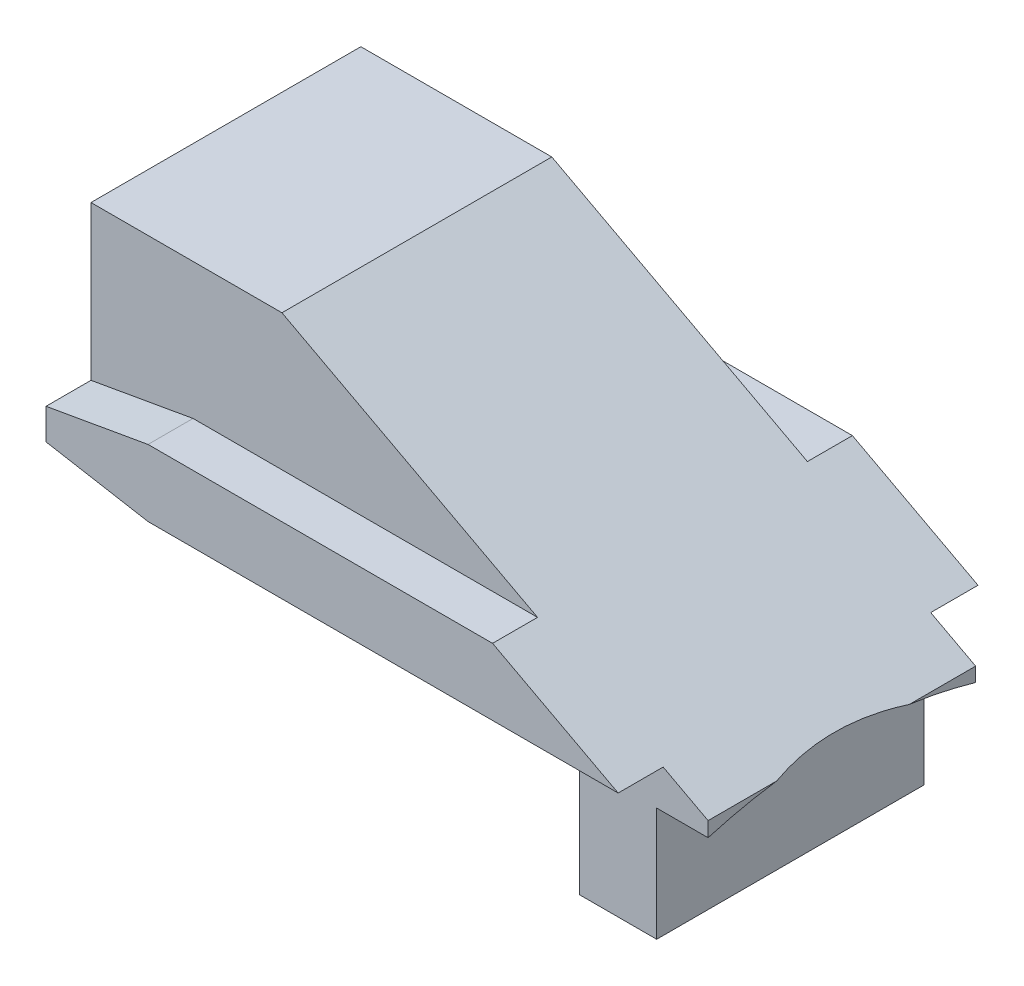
ISO-10303-21;
HEADER;
FILE_DESCRIPTION(('STEP AP214'),'2;1');
FILE_NAME('part.step','',(''),(''),'','','');
FILE_SCHEMA(('AUTOMOTIVE_DESIGN { 1 0 10303 214 1 1 1 1 }'));
ENDSEC;
DATA;
#1=APPLICATION_CONTEXT('core data for automotive mechanical design processes');
#2=APPLICATION_PROTOCOL_DEFINITION('international standard','automotive_design',2000,#1);
#3=PRODUCT_CONTEXT('',#1,'mechanical');
#4=PRODUCT('Part','Part','',(#3));
#5=PRODUCT_RELATED_PRODUCT_CATEGORY('part','',(#4));
#6=PRODUCT_DEFINITION_FORMATION('','',#4);
#7=PRODUCT_DEFINITION_CONTEXT('part definition',#1,'design');
#8=PRODUCT_DEFINITION('design','',#6,#7);
#9=PRODUCT_DEFINITION_SHAPE('','',#8);
#10=(LENGTH_UNIT() NAMED_UNIT(*) SI_UNIT(.MILLI.,.METRE.));
#11=(NAMED_UNIT(*) PLANE_ANGLE_UNIT() SI_UNIT($,.RADIAN.));
#12=(NAMED_UNIT(*) SI_UNIT($,.STERADIAN.) SOLID_ANGLE_UNIT());
#13=UNCERTAINTY_MEASURE_WITH_UNIT(LENGTH_MEASURE(1.E-05),#10,'distance_accuracy_value','');
#14=(GEOMETRIC_REPRESENTATION_CONTEXT(3) GLOBAL_UNCERTAINTY_ASSIGNED_CONTEXT((#13)) GLOBAL_UNIT_ASSIGNED_CONTEXT((#10,
#11,#12)) REPRESENTATION_CONTEXT('',''));
#15=CARTESIAN_POINT('',(0.,0.,0.));
#16=DIRECTION('',(0.,0.,1.));
#17=DIRECTION('',(1.,0.,0.));
#18=AXIS2_PLACEMENT_3D('',#15,#16,#17);
#19=CARTESIAN_POINT('',(20.623730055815,-4.23522905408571,7.26858627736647));
#20=DIRECTION('',(0.,1.,0.));
#21=DIRECTION('',(0.,0.,1.));
#22=AXIS2_PLACEMENT_3D('',#19,#20,#21);
#23=PLANE('',#22);
#24=DIRECTION('',(0.,0.,-1.));
#25=VECTOR('',#24,1.);
#26=CARTESIAN_POINT('',(16.123730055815,-4.23522905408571,7.26858627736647));
#27=LINE('',#26,#25);
#28=CARTESIAN_POINT('',(16.123730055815,-4.23522905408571,4.72608627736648));
#29=VERTEX_POINT('',#28);
#30=CARTESIAN_POINT('',(16.123730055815,-4.23522905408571,-4.64291372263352));
#31=VERTEX_POINT('',#30);
#32=EDGE_CURVE('E315',#29,#31,#27,.T.);
#33=ORIENTED_EDGE('',*,*,#32,.T.);
#34=DIRECTION('',(-1.,0.,0.));
#35=VECTOR('',#34,1.);
#36=CARTESIAN_POINT('',(38.8325356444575,-4.23522905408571,-4.64291372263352));
#37=LINE('',#36,#35);
#38=CARTESIAN_POINT('',(18.823730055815,-4.23522905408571,-4.64291372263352));
#39=VERTEX_POINT('',#38);
#40=EDGE_CURVE('E195',#39,#31,#37,.T.);
#41=ORIENTED_EDGE('',*,*,#40,.F.);
#42=DIRECTION('',(0.,0.,-1.));
#43=VECTOR('',#42,1.);
#44=CARTESIAN_POINT('',(18.823730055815,-4.23522905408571,7.26858627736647));
#45=LINE('',#44,#43);
#46=CARTESIAN_POINT('',(18.823730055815,-4.23522905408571,4.72608627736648));
#47=VERTEX_POINT('',#46);
#48=EDGE_CURVE('E300',#47,#39,#45,.T.);
#49=ORIENTED_EDGE('',*,*,#48,.F.);
#50=DIRECTION('',(-1.,0.,0.));
#51=VECTOR('',#50,1.);
#52=CARTESIAN_POINT('',(38.8325356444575,-4.23522905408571,4.72608627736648));
#53=LINE('',#52,#51);
#54=EDGE_CURVE('E247',#47,#29,#53,.T.);
#55=ORIENTED_EDGE('',*,*,#54,.T.);
#56=EDGE_LOOP('',(#33,#41,#49,#55));
#57=FACE_BOUND('',#56,.T.);
#58=ADVANCED_FACE('F37',(#57),#23,.F.);
#59=CARTESIAN_POINT('',(20.623730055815,0.26477094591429,7.26858627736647));
#60=DIRECTION('',(-1.,0.,0.));
#61=DIRECTION('',(0.,-1.,0.));
#62=AXIS2_PLACEMENT_3D('',#59,#60,#61);
#63=PLANE('',#62);
#64=DIRECTION('',(0.,0.,-1.));
#65=VECTOR('',#64,1.);
#66=CARTESIAN_POINT('',(20.623730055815,0.26477094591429,7.26858627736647));
#67=LINE('',#66,#65);
#68=CARTESIAN_POINT('',(20.623730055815,0.264770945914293,4.72608627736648));
#69=VERTEX_POINT('',#68);
#70=CARTESIAN_POINT('',(20.623730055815,0.26477094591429,2.32308627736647));
#71=VERTEX_POINT('',#70);
#72=EDGE_CURVE('E313',#69,#71,#67,.T.);
#73=ORIENTED_EDGE('',*,*,#72,.F.);
#74=DIRECTION('',(0.,-1.,0.));
#75=VECTOR('',#74,1.);
#76=CARTESIAN_POINT('',(20.623730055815,0.26477094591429,4.72608627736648));
#77=LINE('',#76,#75);
#78=CARTESIAN_POINT('',(20.623730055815,-0.254666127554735,4.72608627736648));
#79=VERTEX_POINT('',#78);
#80=EDGE_CURVE('E275',#69,#79,#77,.T.);
#81=ORIENTED_EDGE('',*,*,#80,.T.);
#82=CARTESIAN_POINT('',(20.623730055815,-16.2952290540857,0.00108627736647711));
#83=DIRECTION('',(1.,0.,0.));
#84=DIRECTION('',(0.,1.,0.));
#85=AXIS2_PLACEMENT_3D('',#82,#83,#84);
#86=CIRCLE('',#85,16.722);
#87=EDGE_CURVE('E301',#71,#79,#86,.T.);
#88=ORIENTED_EDGE('',*,*,#87,.F.);
#89=EDGE_LOOP('',(#73,#81,#88));
#90=FACE_BOUND('',#89,.T.);
#91=ADVANCED_FACE('F387',(#90),#63,.F.);
#92=CARTESIAN_POINT('',(16.123730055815,0.26477094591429,7.26858627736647));
#93=DIRECTION('',(0.,1.,0.));
#94=DIRECTION('',(-1.,0.,0.));
#95=AXIS2_PLACEMENT_3D('',#92,#93,#94);
#96=PLANE('',#95);
#97=DIRECTION('',(0.,0.,-1.));
#98=VECTOR('',#97,1.);
#99=CARTESIAN_POINT('',(-0.985269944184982,0.26477094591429,7.26858627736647));
#100=LINE('',#99,#98);
#101=CARTESIAN_POINT('',(-0.985269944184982,0.26477094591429,4.72608627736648));
#102=VERTEX_POINT('',#101);
#103=CARTESIAN_POINT('',(-0.985269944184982,0.26477094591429,-4.64291372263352));
#104=VERTEX_POINT('',#103);
#105=EDGE_CURVE('E309',#102,#104,#100,.T.);
#106=ORIENTED_EDGE('',*,*,#105,.T.);
#107=DIRECTION('',(1.,0.,0.));
#108=VECTOR('',#107,1.);
#109=CARTESIAN_POINT('',(16.123730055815,0.26477094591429,-4.64291372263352));
#110=LINE('',#109,#108);
#111=CARTESIAN_POINT('',(16.123730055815,0.264770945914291,-4.64291372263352));
#112=VERTEX_POINT('',#111);
#113=EDGE_CURVE('E293',#104,#112,#110,.T.);
#114=ORIENTED_EDGE('',*,*,#113,.T.);
#115=DIRECTION('',(0.,0.,-1.));
#116=VECTOR('',#115,1.);
#117=CARTESIAN_POINT('',(16.123730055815,0.26477094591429,7.26858627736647));
#118=LINE('',#117,#116);
#119=CARTESIAN_POINT('',(16.123730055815,0.264770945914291,4.72608627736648));
#120=VERTEX_POINT('',#119);
#121=EDGE_CURVE('E318',#120,#112,#118,.T.);
#122=ORIENTED_EDGE('',*,*,#121,.F.);
#123=DIRECTION('',(-1.,0.,0.));
#124=VECTOR('',#123,1.);
#125=CARTESIAN_POINT('',(16.123730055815,0.26477094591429,4.72608627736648));
#126=LINE('',#125,#124);
#127=EDGE_CURVE('E281',#120,#102,#126,.T.);
#128=ORIENTED_EDGE('',*,*,#127,.T.);
#129=EDGE_LOOP('',(#106,#114,#122,#128));
#130=FACE_BOUND('',#129,.T.);
#131=ADVANCED_FACE('F393',(#130),#96,.F.);
#132=CARTESIAN_POINT('',(16.123730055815,-4.23522905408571,7.26858627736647));
#133=DIRECTION('',(1.,0.,0.));
#134=DIRECTION('',(0.,0.,-1.));
#135=AXIS2_PLACEMENT_3D('',#132,#133,#134);
#136=PLANE('',#135);
#137=ORIENTED_EDGE('',*,*,#121,.T.);
#138=DIRECTION('',(0.,-1.,0.));
#139=VECTOR('',#138,1.);
#140=CARTESIAN_POINT('',(16.123730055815,-4.23522905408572,-4.64291372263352));
#141=LINE('',#140,#139);
#142=EDGE_CURVE('E290',#112,#31,#141,.T.);
#143=ORIENTED_EDGE('',*,*,#142,.T.);
#144=ORIENTED_EDGE('',*,*,#32,.F.);
#145=DIRECTION('',(0.,1.,0.));
#146=VECTOR('',#145,1.);
#147=CARTESIAN_POINT('',(16.123730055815,-4.23522905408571,4.72608627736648));
#148=LINE('',#147,#146);
#149=EDGE_CURVE('E278',#29,#120,#148,.T.);
#150=ORIENTED_EDGE('',*,*,#149,.T.);
#151=EDGE_LOOP('',(#137,#143,#144,#150));
#152=FACE_BOUND('',#151,.T.);
#153=ADVANCED_FACE('F399',(#152),#136,.F.);
#154=CARTESIAN_POINT('',(20.623730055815,-0.231028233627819,-4.64291372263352));
#155=VERTEX_POINT('',#154);
#156=CARTESIAN_POINT('',(20.623730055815,0.26477094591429,-2.32091372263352));
#157=VERTEX_POINT('',#156);
#158=EDGE_CURVE('E296',#155,#157,#86,.T.);
#159=ORIENTED_EDGE('',*,*,#158,.F.);
#160=DIRECTION('',(0.,1.,0.));
#161=VECTOR('',#160,1.);
#162=CARTESIAN_POINT('',(20.623730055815,0.264770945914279,-4.64291372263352));
#163=LINE('',#162,#161);
#164=CARTESIAN_POINT('',(20.623730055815,0.26477094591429,-4.64291372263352));
#165=VERTEX_POINT('',#164);
#166=EDGE_CURVE('E287',#155,#165,#163,.T.);
#167=ORIENTED_EDGE('',*,*,#166,.T.);
#168=EDGE_CURVE('E312',#157,#165,#67,.T.);
#169=ORIENTED_EDGE('',*,*,#168,.F.);
#170=EDGE_LOOP('',(#159,#167,#169));
#171=FACE_BOUND('',#170,.T.);
#172=ADVANCED_FACE('F396',(#171),#63,.F.);
#173=CARTESIAN_POINT('',(0.814730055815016,10.8037709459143,7.26858627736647));
#174=DIRECTION('',(-0.469692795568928,-0.882829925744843,0.));
#175=DIRECTION('',(0.882829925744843,-0.469692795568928,0.));
#176=AXIS2_PLACEMENT_3D('',#173,#174,#175);
#177=PLANE('',#176);
#178=DIRECTION('',(0.882829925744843,-0.469692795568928,0.));
#179=VECTOR('',#178,1.);
#180=CARTESIAN_POINT('',(30.4453772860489,-4.96064882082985,-4.72391372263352));
#181=LINE('',#180,#179);
#182=CARTESIAN_POINT('',(5.70166430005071,8.20377094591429,-4.72391372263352));
#183=VERTEX_POINT('',#182);
#184=CARTESIAN_POINT('',(14.6522723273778,3.44177094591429,-4.72391372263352));
#185=VERTEX_POINT('',#184);
#186=EDGE_CURVE('E225',#183,#185,#181,.T.);
#187=ORIENTED_EDGE('',*,*,#186,.F.);
#188=DIRECTION('',(0.,0.,-1.));
#189=VECTOR('',#188,1.);
#190=CARTESIAN_POINT('',(5.70166430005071,8.20377094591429,13.3507798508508));
#191=LINE('',#190,#189);
#192=CARTESIAN_POINT('',(5.70166430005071,8.20377094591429,4.72608627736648));
#193=VERTEX_POINT('',#192);
#194=EDGE_CURVE('E206',#193,#183,#191,.T.);
#195=ORIENTED_EDGE('',*,*,#194,.F.);
#196=DIRECTION('',(-0.882829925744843,0.469692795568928,0.));
#197=VECTOR('',#196,1.);
#198=CARTESIAN_POINT('',(33.4980957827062,-6.58478937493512,4.72608627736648));
#199=LINE('',#198,#197);
#200=CARTESIAN_POINT('',(14.6522723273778,3.44177094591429,4.72608627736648));
#201=VERTEX_POINT('',#200);
#202=EDGE_CURVE('E244',#201,#193,#199,.T.);
#203=ORIENTED_EDGE('',*,*,#202,.F.);
#204=DIRECTION('',(0.,0.,-1.));
#205=VECTOR('',#204,1.);
#206=CARTESIAN_POINT('',(14.6522723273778,3.44177094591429,6.3010862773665));
#207=LINE('',#206,#205);
#208=CARTESIAN_POINT('',(14.6522723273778,3.44177094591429,6.30108627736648));
#209=VERTEX_POINT('',#208);
#210=EDGE_CURVE('E246',#209,#201,#207,.T.);
#211=ORIENTED_EDGE('',*,*,#210,.F.);
#212=DIRECTION('',(-0.882829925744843,0.469692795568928,0.));
#213=VECTOR('',#212,1.);
#214=CARTESIAN_POINT('',(34.4683975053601,-7.10101986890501,6.30108627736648));
#215=LINE('',#214,#213);
#216=CARTESIAN_POINT('',(19.0505131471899,1.10177094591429,6.30108627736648));
#217=VERTEX_POINT('',#216);
#218=EDGE_CURVE('E249',#217,#209,#215,.T.);
#219=ORIENTED_EDGE('',*,*,#218,.F.);
#220=DIRECTION('',(0.,0.,1.));
#221=VECTOR('',#220,1.);
#222=CARTESIAN_POINT('',(19.0505131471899,1.10177094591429,4.72608627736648));
#223=LINE('',#222,#221);
#224=CARTESIAN_POINT('',(19.0505131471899,1.10177094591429,4.72608627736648));
#225=VERTEX_POINT('',#224);
#226=EDGE_CURVE('E251',#225,#217,#223,.T.);
#227=ORIENTED_EDGE('',*,*,#226,.F.);
#228=DIRECTION('',(-0.882829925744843,0.469692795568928,0.));
#229=VECTOR('',#228,1.);
#230=CARTESIAN_POINT('',(34.815466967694,-7.28567154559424,4.72608627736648));
#231=LINE('',#230,#229);
#232=EDGE_CURVE('E230',#69,#225,#231,.T.);
#233=ORIENTED_EDGE('',*,*,#232,.F.);
#234=ORIENTED_EDGE('',*,*,#72,.T.);
#235=CARTESIAN_POINT('',(51.7497420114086,-16.2952290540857,0.00108627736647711));
#236=DIRECTION('',(-0.469692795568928,-0.882829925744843,0.));
#237=DIRECTION('',(0.882829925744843,-0.469692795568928,0.));
#238=AXIS2_PLACEMENT_3D('',#235,#236,#237);
#239=ELLIPSE('',#238,35.6019938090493,16.722);
#240=EDGE_CURVE('E306',#71,#157,#239,.T.);
#241=ORIENTED_EDGE('',*,*,#240,.T.);
#242=ORIENTED_EDGE('',*,*,#168,.T.);
#243=DIRECTION('',(0.882829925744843,-0.469692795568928,0.));
#244=VECTOR('',#243,1.);
#245=CARTESIAN_POINT('',(34.4683975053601,-7.10101986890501,-4.64291372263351));
#246=LINE('',#245,#244);
#247=CARTESIAN_POINT('',(19.0505131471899,1.10177094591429,-4.64291372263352));
#248=VERTEX_POINT('',#247);
#249=EDGE_CURVE('E216',#248,#165,#246,.T.);
#250=ORIENTED_EDGE('',*,*,#249,.F.);
#251=DIRECTION('',(0.,0.,1.));
#252=VECTOR('',#251,1.);
#253=CARTESIAN_POINT('',(19.0505131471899,1.10177094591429,-6.29891372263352));
#254=LINE('',#253,#252);
#255=CARTESIAN_POINT('',(19.0505131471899,1.10177094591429,-6.29891372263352));
#256=VERTEX_POINT('',#255);
#257=EDGE_CURVE('E218',#256,#248,#254,.T.);
#258=ORIENTED_EDGE('',*,*,#257,.F.);
#259=DIRECTION('',(0.882829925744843,-0.469692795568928,0.));
#260=VECTOR('',#259,1.);
#261=CARTESIAN_POINT('',(33.4980957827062,-6.58478937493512,-6.29891372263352));
#262=LINE('',#261,#260);
#263=CARTESIAN_POINT('',(14.6522723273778,3.44177094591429,-6.29891372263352));
#264=VERTEX_POINT('',#263);
#265=EDGE_CURVE('E221',#264,#256,#262,.T.);
#266=ORIENTED_EDGE('',*,*,#265,.F.);
#267=DIRECTION('',(0.,0.,-1.));
#268=VECTOR('',#267,1.);
#269=CARTESIAN_POINT('',(14.6522723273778,3.44177094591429,-4.72391372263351));
#270=LINE('',#269,#268);
#271=EDGE_CURVE('E223',#185,#264,#270,.T.);
#272=ORIENTED_EDGE('',*,*,#271,.F.);
#273=EDGE_LOOP('',(#187,#195,#203,#211,#219,#227,#233,#234,#241,#242,#250,#258,#266,#272));
#274=FACE_BOUND('',#273,.T.);
#275=ADVANCED_FACE('F375',(#274),#177,.F.);
#276=CARTESIAN_POINT('',(-0.985269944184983,10.8037709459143,7.26858627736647));
#277=DIRECTION('',(1.,0.,0.));
#278=DIRECTION('',(0.,1.,0.));
#279=AXIS2_PLACEMENT_3D('',#276,#277,#278);
#280=PLANE('',#279);
#281=DIRECTION('',(0.,-1.,0.));
#282=VECTOR('',#281,1.);
#283=CARTESIAN_POINT('',(-0.985269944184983,3.44177094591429,4.72608627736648));
#284=LINE('',#283,#282);
#285=CARTESIAN_POINT('',(-0.985269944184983,8.20377094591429,4.72608627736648));
#286=VERTEX_POINT('',#285);
#287=CARTESIAN_POINT('',(-0.985269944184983,2.81177094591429,4.72608627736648));
#288=VERTEX_POINT('',#287);
#289=EDGE_CURVE('E202',#286,#288,#284,.T.);
#290=ORIENTED_EDGE('',*,*,#289,.F.);
#291=DIRECTION('',(0.,0.,-1.));
#292=VECTOR('',#291,1.);
#293=CARTESIAN_POINT('',(-0.985269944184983,8.20377094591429,13.3507798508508));
#294=LINE('',#293,#292);
#295=CARTESIAN_POINT('',(-0.985269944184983,8.20377094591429,-4.72391372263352));
#296=VERTEX_POINT('',#295);
#297=EDGE_CURVE('E199',#286,#296,#294,.T.);
#298=ORIENTED_EDGE('',*,*,#297,.T.);
#299=DIRECTION('',(0.,1.,0.));
#300=VECTOR('',#299,1.);
#301=CARTESIAN_POINT('',(-0.985269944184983,10.8037709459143,-4.72391372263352));
#302=LINE('',#301,#300);
#303=CARTESIAN_POINT('',(-0.985269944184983,2.81177094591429,-4.72391372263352));
#304=VERTEX_POINT('',#303);
#305=EDGE_CURVE('E186',#304,#296,#302,.T.);
#306=ORIENTED_EDGE('',*,*,#305,.F.);
#307=DIRECTION('',(0.,0.,-1.));
#308=VECTOR('',#307,1.);
#309=CARTESIAN_POINT('',(-0.985269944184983,2.81177094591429,7.26858627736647));
#310=LINE('',#309,#308);
#311=CARTESIAN_POINT('',(-0.985269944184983,2.81177094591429,-6.29891372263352));
#312=VERTEX_POINT('',#311);
#313=EDGE_CURVE('E336',#304,#312,#310,.T.);
#314=ORIENTED_EDGE('',*,*,#313,.T.);
#315=DIRECTION('',(0.,1.,0.));
#316=VECTOR('',#315,1.);
#317=CARTESIAN_POINT('',(-0.985269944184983,3.44177094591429,-6.29891372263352));
#318=LINE('',#317,#316);
#319=CARTESIAN_POINT('',(-0.985269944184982,1.73177094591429,-6.29891372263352));
#320=VERTEX_POINT('',#319);
#321=EDGE_CURVE('E196',#320,#312,#318,.T.);
#322=ORIENTED_EDGE('',*,*,#321,.F.);
#323=DIRECTION('',(0.,0.,1.));
#324=VECTOR('',#323,1.);
#325=CARTESIAN_POINT('',(-0.985269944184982,1.73177094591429,7.26858627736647));
#326=LINE('',#325,#324);
#327=CARTESIAN_POINT('',(-0.985269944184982,1.73177094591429,-4.64291372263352));
#328=VERTEX_POINT('',#327);
#329=EDGE_CURVE('E338',#320,#328,#326,.T.);
#330=ORIENTED_EDGE('',*,*,#329,.T.);
#331=DIRECTION('',(0.,1.,0.));
#332=VECTOR('',#331,1.);
#333=CARTESIAN_POINT('',(-0.985269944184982,1.10177094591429,-4.64291372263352));
#334=LINE('',#333,#332);
#335=EDGE_CURVE('E228',#104,#328,#334,.T.);
#336=ORIENTED_EDGE('',*,*,#335,.F.);
#337=ORIENTED_EDGE('',*,*,#105,.F.);
#338=DIRECTION('',(0.,-1.,0.));
#339=VECTOR('',#338,1.);
#340=CARTESIAN_POINT('',(-0.985269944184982,0.26477094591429,4.72608627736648));
#341=LINE('',#340,#339);
#342=CARTESIAN_POINT('',(-0.985269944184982,1.73177094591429,4.72608627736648));
#343=VERTEX_POINT('',#342);
#344=EDGE_CURVE('E258',#343,#102,#341,.T.);
#345=ORIENTED_EDGE('',*,*,#344,.F.);
#346=DIRECTION('',(0.,0.,1.));
#347=VECTOR('',#346,1.);
#348=CARTESIAN_POINT('',(-0.985269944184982,1.73177094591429,7.26858627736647));
#349=LINE('',#348,#347);
#350=CARTESIAN_POINT('',(-0.985269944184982,1.73177094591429,6.30108627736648));
#351=VERTEX_POINT('',#350);
#352=EDGE_CURVE('E334',#343,#351,#349,.T.);
#353=ORIENTED_EDGE('',*,*,#352,.T.);
#354=DIRECTION('',(0.,-1.,0.));
#355=VECTOR('',#354,1.);
#356=CARTESIAN_POINT('',(-0.985269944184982,1.10177094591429,6.30108627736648));
#357=LINE('',#356,#355);
#358=CARTESIAN_POINT('',(-0.985269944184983,2.81177094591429,6.30108627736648));
#359=VERTEX_POINT('',#358);
#360=EDGE_CURVE('E255',#359,#351,#357,.T.);
#361=ORIENTED_EDGE('',*,*,#360,.F.);
#362=DIRECTION('',(0.,0.,-1.));
#363=VECTOR('',#362,1.);
#364=CARTESIAN_POINT('',(-0.985269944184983,2.81177094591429,7.26858627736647));
#365=LINE('',#364,#363);
#366=EDGE_CURVE('E332',#359,#288,#365,.T.);
#367=ORIENTED_EDGE('',*,*,#366,.T.);
#368=EDGE_LOOP('',(#290,#298,#306,#314,#322,#330,#336,#337,#345,#353,#361,#367));
#369=FACE_BOUND('',#368,.T.);
#370=ADVANCED_FACE('F200',(#369),#280,.F.);
#371=CARTESIAN_POINT('',(18.823730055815,-16.2952290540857,0.00108627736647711));
#372=DIRECTION('',(1.,0.,0.));
#373=DIRECTION('',(0.,1.,0.));
#374=AXIS2_PLACEMENT_3D('',#371,#372,#373);
#375=CYLINDRICAL_SURFACE('',#374,16.722);
#376=CARTESIAN_POINT('',(18.823730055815,-16.2952290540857,0.00108627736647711));
#377=DIRECTION('',(1.,0.,0.));
#378=DIRECTION('',(0.,1.,0.));
#379=AXIS2_PLACEMENT_3D('',#376,#377,#378);
#380=CIRCLE('',#379,16.722);
#381=CARTESIAN_POINT('',(18.823730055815,-0.231028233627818,-4.64291372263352));
#382=VERTEX_POINT('',#381);
#383=CARTESIAN_POINT('',(18.823730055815,-0.254666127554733,4.72608627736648));
#384=VERTEX_POINT('',#383);
#385=EDGE_CURVE('E297',#382,#384,#380,.T.);
#386=ORIENTED_EDGE('',*,*,#385,.F.);
#387=DIRECTION('',(1.,0.,0.));
#388=VECTOR('',#387,1.);
#389=CARTESIAN_POINT('',(18.823730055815,-0.231028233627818,-4.64291372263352));
#390=LINE('',#389,#388);
#391=EDGE_CURVE('E284',#382,#155,#390,.T.);
#392=ORIENTED_EDGE('',*,*,#391,.T.);
#393=ORIENTED_EDGE('',*,*,#158,.T.);
#394=ORIENTED_EDGE('',*,*,#240,.F.);
#395=ORIENTED_EDGE('',*,*,#87,.T.);
#396=DIRECTION('',(1.,0.,0.));
#397=VECTOR('',#396,1.);
#398=CARTESIAN_POINT('',(18.823730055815,-0.254666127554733,4.72608627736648));
#399=LINE('',#398,#397);
#400=EDGE_CURVE('E227',#79,#384,#399,.F.);
#401=ORIENTED_EDGE('',*,*,#400,.T.);
#402=EDGE_LOOP('',(#386,#392,#393,#394,#395,#401));
#403=FACE_BOUND('',#402,.T.);
#404=ADVANCED_FACE('F446',(#403),#375,.F.);
#405=CARTESIAN_POINT('',(18.823730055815,-16.2952290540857,0.00108627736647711));
#406=DIRECTION('',(1.,0.,0.));
#407=DIRECTION('',(0.,1.,0.));
#408=AXIS2_PLACEMENT_3D('',#405,#406,#407);
#409=PLANE('',#408);
#410=DIRECTION('',(0.,-1.,0.));
#411=VECTOR('',#410,1.);
#412=CARTESIAN_POINT('',(18.823730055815,-16.2952290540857,-4.64291372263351));
#413=LINE('',#412,#411);
#414=EDGE_CURVE('E323',#382,#39,#413,.T.);
#415=ORIENTED_EDGE('',*,*,#414,.F.);
#416=ORIENTED_EDGE('',*,*,#385,.T.);
#417=DIRECTION('',(0.,1.,0.));
#418=VECTOR('',#417,1.);
#419=CARTESIAN_POINT('',(18.823730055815,-16.2952290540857,4.72608627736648));
#420=LINE('',#419,#418);
#421=EDGE_CURVE('E321',#47,#384,#420,.T.);
#422=ORIENTED_EDGE('',*,*,#421,.F.);
#423=ORIENTED_EDGE('',*,*,#48,.T.);
#424=EDGE_LOOP('',(#415,#416,#422,#423));
#425=FACE_BOUND('',#424,.T.);
#426=ADVANCED_FACE('F443',(#425),#409,.T.);
#427=CARTESIAN_POINT('',(38.8325356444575,0.264770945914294,4.72608627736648));
#428=DIRECTION('',(0.,0.,-1.));
#429=DIRECTION('',(0.,1.,0.));
#430=AXIS2_PLACEMENT_3D('',#427,#428,#429);
#431=PLANE('',#430);
#432=ORIENTED_EDGE('',*,*,#149,.F.);
#433=ORIENTED_EDGE('',*,*,#54,.F.);
#434=ORIENTED_EDGE('',*,*,#421,.T.);
#435=ORIENTED_EDGE('',*,*,#400,.F.);
#436=ORIENTED_EDGE('',*,*,#80,.F.);
#437=ORIENTED_EDGE('',*,*,#232,.T.);
#438=DIRECTION('',(-1.,0.,0.));
#439=VECTOR('',#438,1.);
#440=CARTESIAN_POINT('',(38.8325356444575,1.1017709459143,4.72608627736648));
#441=LINE('',#440,#439);
#442=CARTESIAN_POINT('',(2.58763760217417,1.10177094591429,4.72608627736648));
#443=VERTEX_POINT('',#442);
#444=EDGE_CURVE('E263',#225,#443,#441,.T.);
#445=ORIENTED_EDGE('',*,*,#444,.T.);
#446=DIRECTION('',(0.984807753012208,-0.17364817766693,0.));
#447=VECTOR('',#446,1.);
#448=CARTESIAN_POINT('',(37.8827536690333,-5.12171030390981,4.72608627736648));
#449=LINE('',#448,#447);
#450=EDGE_CURVE('E45',#443,#343,#449,.F.);
#451=ORIENTED_EDGE('',*,*,#450,.T.);
#452=ORIENTED_EDGE('',*,*,#344,.T.);
#453=ORIENTED_EDGE('',*,*,#127,.F.);
#454=EDGE_LOOP('',(#432,#433,#434,#435,#436,#437,#445,#451,#452,#453));
#455=FACE_BOUND('',#454,.T.);
#456=ADVANCED_FACE('F357',(#455),#431,.F.);
#457=CARTESIAN_POINT('',(38.8325356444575,1.1017709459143,4.72608627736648));
#458=DIRECTION('',(0.,1.,0.));
#459=DIRECTION('',(-1.,0.,0.));
#460=AXIS2_PLACEMENT_3D('',#457,#458,#459);
#461=PLANE('',#460);
#462=DIRECTION('',(-1.,0.,0.));
#463=VECTOR('',#462,1.);
#464=CARTESIAN_POINT('',(38.8325356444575,1.1017709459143,6.30108627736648));
#465=LINE('',#464,#463);
#466=CARTESIAN_POINT('',(2.58763760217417,1.10177094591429,6.30108627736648));
#467=VERTEX_POINT('',#466);
#468=EDGE_CURVE('E266',#217,#467,#465,.T.);
#469=ORIENTED_EDGE('',*,*,#468,.T.);
#470=DIRECTION('',(0.,0.,-1.));
#471=VECTOR('',#470,1.);
#472=CARTESIAN_POINT('',(2.58763760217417,1.10177094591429,4.72608627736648));
#473=LINE('',#472,#471);
#474=EDGE_CURVE('E344',#467,#443,#473,.T.);
#475=ORIENTED_EDGE('',*,*,#474,.T.);
#476=ORIENTED_EDGE('',*,*,#444,.F.);
#477=ORIENTED_EDGE('',*,*,#226,.T.);
#478=EDGE_LOOP('',(#469,#475,#476,#477));
#479=FACE_BOUND('',#478,.T.);
#480=ADVANCED_FACE('F471',(#479),#461,.F.);
#481=CARTESIAN_POINT('',(38.8325356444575,1.1017709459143,6.30108627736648));
#482=DIRECTION('',(0.,0.,-1.));
#483=DIRECTION('',(-1.,0.,0.));
#484=AXIS2_PLACEMENT_3D('',#481,#482,#483);
#485=PLANE('',#484);
#486=ORIENTED_EDGE('',*,*,#360,.T.);
#487=DIRECTION('',(-0.984807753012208,0.17364817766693,0.));
#488=VECTOR('',#487,1.);
#489=CARTESIAN_POINT('',(2.58763760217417,1.10177094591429,6.30108627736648));
#490=LINE('',#489,#488);
#491=EDGE_CURVE('E348',#351,#467,#490,.F.);
#492=ORIENTED_EDGE('',*,*,#491,.T.);
#493=ORIENTED_EDGE('',*,*,#468,.F.);
#494=ORIENTED_EDGE('',*,*,#218,.T.);
#495=DIRECTION('',(-1.,0.,0.));
#496=VECTOR('',#495,1.);
#497=CARTESIAN_POINT('',(38.8325356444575,3.44177094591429,6.30108627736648));
#498=LINE('',#497,#496);
#499=CARTESIAN_POINT('',(2.58763760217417,3.44177094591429,6.30108627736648));
#500=VERTEX_POINT('',#499);
#501=EDGE_CURVE('E269',#209,#500,#498,.T.);
#502=ORIENTED_EDGE('',*,*,#501,.T.);
#503=DIRECTION('',(0.984807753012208,0.173648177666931,0.));
#504=VECTOR('',#503,1.);
#505=CARTESIAN_POINT('',(2.58763760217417,3.44177094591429,6.30108627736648));
#506=LINE('',#505,#504);
#507=EDGE_CURVE('E58',#500,#359,#506,.F.);
#508=ORIENTED_EDGE('',*,*,#507,.T.);
#509=EDGE_LOOP('',(#486,#492,#493,#494,#502,#508));
#510=FACE_BOUND('',#509,.T.);
#511=ADVANCED_FACE('F366',(#510),#485,.F.);
#512=CARTESIAN_POINT('',(38.8325356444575,3.44177094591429,6.30108627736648));
#513=DIRECTION('',(0.,-1.,0.));
#514=DIRECTION('',(0.,0.,-1.));
#515=AXIS2_PLACEMENT_3D('',#512,#513,#514);
#516=PLANE('',#515);
#517=DIRECTION('',(-1.,0.,0.));
#518=VECTOR('',#517,1.);
#519=CARTESIAN_POINT('',(38.8325356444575,3.4417709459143,4.72608627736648));
#520=LINE('',#519,#518);
#521=CARTESIAN_POINT('',(2.58763760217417,3.44177094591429,4.72608627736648));
#522=VERTEX_POINT('',#521);
#523=EDGE_CURVE('E260',#201,#522,#520,.T.);
#524=ORIENTED_EDGE('',*,*,#523,.T.);
#525=DIRECTION('',(0.,0.,1.));
#526=VECTOR('',#525,1.);
#527=CARTESIAN_POINT('',(2.58763760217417,3.44177094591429,6.30108627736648));
#528=LINE('',#527,#526);
#529=EDGE_CURVE('E350',#522,#500,#528,.T.);
#530=ORIENTED_EDGE('',*,*,#529,.T.);
#531=ORIENTED_EDGE('',*,*,#501,.F.);
#532=ORIENTED_EDGE('',*,*,#210,.T.);
#533=EDGE_LOOP('',(#524,#530,#531,#532));
#534=FACE_BOUND('',#533,.T.);
#535=ADVANCED_FACE('F372',(#534),#516,.F.);
#536=CARTESIAN_POINT('',(38.8325356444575,3.4417709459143,4.72608627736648));
#537=DIRECTION('',(0.,0.,-1.));
#538=DIRECTION('',(-1.,0.,0.));
#539=AXIS2_PLACEMENT_3D('',#536,#537,#538);
#540=PLANE('',#539);
#541=ORIENTED_EDGE('',*,*,#202,.T.);
#542=DIRECTION('',(-1.,0.,0.));
#543=VECTOR('',#542,1.);
#544=CARTESIAN_POINT('',(5.70166430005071,8.20377094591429,4.72608627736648));
#545=LINE('',#544,#543);
#546=EDGE_CURVE('E214',#193,#286,#545,.T.);
#547=ORIENTED_EDGE('',*,*,#546,.T.);
#548=ORIENTED_EDGE('',*,*,#289,.T.);
#549=DIRECTION('',(-0.984807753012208,-0.173648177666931,0.));
#550=VECTOR('',#549,1.);
#551=CARTESIAN_POINT('',(37.7396182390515,9.64001355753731,4.72608627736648));
#552=LINE('',#551,#550);
#553=EDGE_CURVE('E11',#288,#522,#552,.F.);
#554=ORIENTED_EDGE('',*,*,#553,.T.);
#555=ORIENTED_EDGE('',*,*,#523,.F.);
#556=EDGE_LOOP('',(#541,#547,#548,#554,#555));
#557=FACE_BOUND('',#556,.T.);
#558=ADVANCED_FACE('F377',(#557),#540,.F.);
#559=CARTESIAN_POINT('',(38.8325356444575,1.1017709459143,-4.64291372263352));
#560=DIRECTION('',(0.,0.,1.));
#561=DIRECTION('',(0.,-1.,0.));
#562=AXIS2_PLACEMENT_3D('',#559,#560,#561);
#563=PLANE('',#562);
#564=ORIENTED_EDGE('',*,*,#335,.T.);
#565=DIRECTION('',(-0.984807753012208,0.17364817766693,0.));
#566=VECTOR('',#565,1.);
#567=CARTESIAN_POINT('',(37.7396182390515,-5.09647166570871,-4.64291372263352));
#568=LINE('',#567,#566);
#569=CARTESIAN_POINT('',(2.58763760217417,1.10177094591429,-4.64291372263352));
#570=VERTEX_POINT('',#569);
#571=EDGE_CURVE('E352',#328,#570,#568,.F.);
#572=ORIENTED_EDGE('',*,*,#571,.T.);
#573=DIRECTION('',(-1.,0.,0.));
#574=VECTOR('',#573,1.);
#575=CARTESIAN_POINT('',(38.8325356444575,1.1017709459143,-4.64291372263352));
#576=LINE('',#575,#574);
#577=EDGE_CURVE('E240',#248,#570,#576,.T.);
#578=ORIENTED_EDGE('',*,*,#577,.F.);
#579=ORIENTED_EDGE('',*,*,#249,.T.);
#580=ORIENTED_EDGE('',*,*,#166,.F.);
#581=ORIENTED_EDGE('',*,*,#391,.F.);
#582=ORIENTED_EDGE('',*,*,#414,.T.);
#583=ORIENTED_EDGE('',*,*,#40,.T.);
#584=ORIENTED_EDGE('',*,*,#142,.F.);
#585=ORIENTED_EDGE('',*,*,#113,.F.);
#586=EDGE_LOOP('',(#564,#572,#578,#579,#580,#581,#582,#583,#584,#585));
#587=FACE_BOUND('',#586,.T.);
#588=ADVANCED_FACE('F455',(#587),#563,.F.);
#589=CARTESIAN_POINT('',(38.8325356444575,10.8037709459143,-4.72391372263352));
#590=DIRECTION('',(0.,0.,1.));
#591=DIRECTION('',(0.,-1.,0.));
#592=AXIS2_PLACEMENT_3D('',#589,#590,#591);
#593=PLANE('',#592);
#594=ORIENTED_EDGE('',*,*,#305,.T.);
#595=DIRECTION('',(1.,0.,0.));
#596=VECTOR('',#595,1.);
#597=CARTESIAN_POINT('',(5.70166430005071,8.20377094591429,-4.72391372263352));
#598=LINE('',#597,#596);
#599=EDGE_CURVE('E190',#296,#183,#598,.T.);
#600=ORIENTED_EDGE('',*,*,#599,.T.);
#601=ORIENTED_EDGE('',*,*,#186,.T.);
#602=DIRECTION('',(-1.,0.,0.));
#603=VECTOR('',#602,1.);
#604=CARTESIAN_POINT('',(38.8325356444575,3.44177094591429,-4.72391372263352));
#605=LINE('',#604,#603);
#606=CARTESIAN_POINT('',(2.58763760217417,3.44177094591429,-4.72391372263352));
#607=VERTEX_POINT('',#606);
#608=EDGE_CURVE('E219',#185,#607,#605,.T.);
#609=ORIENTED_EDGE('',*,*,#608,.T.);
#610=DIRECTION('',(0.984807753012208,0.173648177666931,0.));
#611=VECTOR('',#610,1.);
#612=CARTESIAN_POINT('',(38.9985943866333,9.86200502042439,-4.72391372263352));
#613=LINE('',#612,#611);
#614=EDGE_CURVE('E192',#607,#304,#613,.F.);
#615=ORIENTED_EDGE('',*,*,#614,.T.);
#616=EDGE_LOOP('',(#594,#600,#601,#609,#615));
#617=FACE_BOUND('',#616,.T.);
#618=ADVANCED_FACE('F188',(#617),#593,.F.);
#619=CARTESIAN_POINT('',(38.8325356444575,3.44177094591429,-4.72391372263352));
#620=DIRECTION('',(0.,-1.,0.));
#621=DIRECTION('',(0.,0.,-1.));
#622=AXIS2_PLACEMENT_3D('',#619,#620,#621);
#623=PLANE('',#622);
#624=DIRECTION('',(-1.,0.,0.));
#625=VECTOR('',#624,1.);
#626=CARTESIAN_POINT('',(38.8325356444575,3.44177094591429,-6.29891372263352));
#627=LINE('',#626,#625);
#628=CARTESIAN_POINT('',(2.58763760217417,3.44177094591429,-6.29891372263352));
#629=VERTEX_POINT('',#628);
#630=EDGE_CURVE('E234',#264,#629,#627,.T.);
#631=ORIENTED_EDGE('',*,*,#630,.T.);
#632=DIRECTION('',(0.,0.,1.));
#633=VECTOR('',#632,1.);
#634=CARTESIAN_POINT('',(2.58763760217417,3.44177094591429,-4.72391372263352));
#635=LINE('',#634,#633);
#636=EDGE_CURVE('E341',#629,#607,#635,.T.);
#637=ORIENTED_EDGE('',*,*,#636,.T.);
#638=ORIENTED_EDGE('',*,*,#608,.F.);
#639=ORIENTED_EDGE('',*,*,#271,.T.);
#640=EDGE_LOOP('',(#631,#637,#638,#639));
#641=FACE_BOUND('',#640,.T.);
#642=ADVANCED_FACE('F423',(#641),#623,.F.);
#643=CARTESIAN_POINT('',(38.8325356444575,3.44177094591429,-6.29891372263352));
#644=DIRECTION('',(0.,0.,1.));
#645=DIRECTION('',(1.,0.,0.));
#646=AXIS2_PLACEMENT_3D('',#643,#644,#645);
#647=PLANE('',#646);
#648=DIRECTION('',(-1.,0.,0.));
#649=VECTOR('',#648,1.);
#650=CARTESIAN_POINT('',(38.8325356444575,1.1017709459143,-6.29891372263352));
#651=LINE('',#650,#649);
#652=CARTESIAN_POINT('',(2.58763760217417,1.10177094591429,-6.29891372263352));
#653=VERTEX_POINT('',#652);
#654=EDGE_CURVE('E237',#256,#653,#651,.T.);
#655=ORIENTED_EDGE('',*,*,#654,.T.);
#656=DIRECTION('',(0.984807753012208,-0.17364817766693,0.));
#657=VECTOR('',#656,1.);
#658=CARTESIAN_POINT('',(2.58763760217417,1.10177094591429,-6.29891372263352));
#659=LINE('',#658,#657);
#660=EDGE_CURVE('E330',#653,#320,#659,.F.);
#661=ORIENTED_EDGE('',*,*,#660,.T.);
#662=ORIENTED_EDGE('',*,*,#321,.T.);
#663=DIRECTION('',(-0.984807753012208,-0.173648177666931,0.));
#664=VECTOR('',#663,1.);
#665=CARTESIAN_POINT('',(2.58763760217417,3.44177094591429,-6.29891372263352));
#666=LINE('',#665,#664);
#667=EDGE_CURVE('E328',#312,#629,#666,.F.);
#668=ORIENTED_EDGE('',*,*,#667,.T.);
#669=ORIENTED_EDGE('',*,*,#630,.F.);
#670=ORIENTED_EDGE('',*,*,#265,.T.);
#671=EDGE_LOOP('',(#655,#661,#662,#668,#669,#670));
#672=FACE_BOUND('',#671,.T.);
#673=ADVANCED_FACE('F419',(#672),#647,.F.);
#674=CARTESIAN_POINT('',(38.8325356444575,1.1017709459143,-6.29891372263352));
#675=DIRECTION('',(0.,1.,0.));
#676=DIRECTION('',(-1.,0.,0.));
#677=AXIS2_PLACEMENT_3D('',#674,#675,#676);
#678=PLANE('',#677);
#679=ORIENTED_EDGE('',*,*,#577,.T.);
#680=DIRECTION('',(0.,0.,-1.));
#681=VECTOR('',#680,1.);
#682=CARTESIAN_POINT('',(2.58763760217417,1.10177094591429,-6.29891372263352));
#683=LINE('',#682,#681);
#684=EDGE_CURVE('E325',#570,#653,#683,.T.);
#685=ORIENTED_EDGE('',*,*,#684,.T.);
#686=ORIENTED_EDGE('',*,*,#654,.F.);
#687=ORIENTED_EDGE('',*,*,#257,.T.);
#688=EDGE_LOOP('',(#679,#685,#686,#687));
#689=FACE_BOUND('',#688,.T.);
#690=ADVANCED_FACE('F409',(#689),#678,.F.);
#691=CARTESIAN_POINT('',(2.58763760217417,1.10177094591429,-6.29891372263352));
#692=DIRECTION('',(0.17364817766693,0.984807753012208,0.));
#693=DIRECTION('',(0.,0.,-1.));
#694=AXIS2_PLACEMENT_3D('',#691,#692,#693);
#695=PLANE('',#694);
#696=ORIENTED_EDGE('',*,*,#571,.F.);
#697=ORIENTED_EDGE('',*,*,#329,.F.);
#698=ORIENTED_EDGE('',*,*,#660,.F.);
#699=ORIENTED_EDGE('',*,*,#684,.F.);
#700=EDGE_LOOP('',(#696,#697,#698,#699));
#701=FACE_BOUND('',#700,.T.);
#702=ADVANCED_FACE('F406',(#701),#695,.F.);
#703=CARTESIAN_POINT('',(2.58763760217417,3.44177094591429,-4.72391372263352));
#704=DIRECTION('',(0.173648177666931,-0.984807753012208,0.));
#705=DIRECTION('',(0.,0.,1.));
#706=AXIS2_PLACEMENT_3D('',#703,#704,#705);
#707=PLANE('',#706);
#708=ORIENTED_EDGE('',*,*,#667,.F.);
#709=ORIENTED_EDGE('',*,*,#313,.F.);
#710=ORIENTED_EDGE('',*,*,#614,.F.);
#711=ORIENTED_EDGE('',*,*,#636,.F.);
#712=EDGE_LOOP('',(#708,#709,#710,#711));
#713=FACE_BOUND('',#712,.T.);
#714=ADVANCED_FACE('F385',(#713),#707,.F.);
#715=CARTESIAN_POINT('',(2.58763760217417,1.10177094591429,4.72608627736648));
#716=DIRECTION('',(0.17364817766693,0.984807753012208,0.));
#717=DIRECTION('',(0.,0.,-1.));
#718=AXIS2_PLACEMENT_3D('',#715,#716,#717);
#719=PLANE('',#718);
#720=ORIENTED_EDGE('',*,*,#491,.F.);
#721=ORIENTED_EDGE('',*,*,#352,.F.);
#722=ORIENTED_EDGE('',*,*,#450,.F.);
#723=ORIENTED_EDGE('',*,*,#474,.F.);
#724=EDGE_LOOP('',(#720,#721,#722,#723));
#725=FACE_BOUND('',#724,.T.);
#726=ADVANCED_FACE('F362',(#725),#719,.F.);
#727=CARTESIAN_POINT('',(2.58763760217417,3.44177094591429,6.30108627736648));
#728=DIRECTION('',(0.173648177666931,-0.984807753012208,0.));
#729=DIRECTION('',(0.,0.,1.));
#730=AXIS2_PLACEMENT_3D('',#727,#728,#729);
#731=PLANE('',#730);
#732=ORIENTED_EDGE('',*,*,#553,.F.);
#733=ORIENTED_EDGE('',*,*,#366,.F.);
#734=ORIENTED_EDGE('',*,*,#507,.F.);
#735=ORIENTED_EDGE('',*,*,#529,.F.);
#736=EDGE_LOOP('',(#732,#733,#734,#735));
#737=FACE_BOUND('',#736,.T.);
#738=ADVANCED_FACE('F39',(#737),#731,.F.);
#739=CARTESIAN_POINT('',(5.70166430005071,8.20377094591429,13.3507798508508));
#740=DIRECTION('',(0.,1.,0.));
#741=DIRECTION('',(0.,0.,1.));
#742=AXIS2_PLACEMENT_3D('',#739,#740,#741);
#743=PLANE('',#742);
#744=ORIENTED_EDGE('',*,*,#546,.F.);
#745=ORIENTED_EDGE('',*,*,#194,.T.);
#746=ORIENTED_EDGE('',*,*,#599,.F.);
#747=ORIENTED_EDGE('',*,*,#297,.F.);
#748=EDGE_LOOP('',(#744,#745,#746,#747));
#749=FACE_BOUND('',#748,.T.);
#750=ADVANCED_FACE('F209',(#749),#743,.T.);
#751=CLOSED_SHELL('',(#58,#91,#131,#153,#172,#275,#370,#404,#426,#456,#480,#511,#535,#558,#588,
#618,#642,#673,#690,#702,#714,#726,#738,#750));
#752=MANIFOLD_SOLID_BREP('B2',#751);
#753=ADVANCED_BREP_SHAPE_REPRESENTATION('',(#18,#752),#14);
#754=SHAPE_DEFINITION_REPRESENTATION(#9,#753);
ENDSEC;
END-ISO-10303-21;
